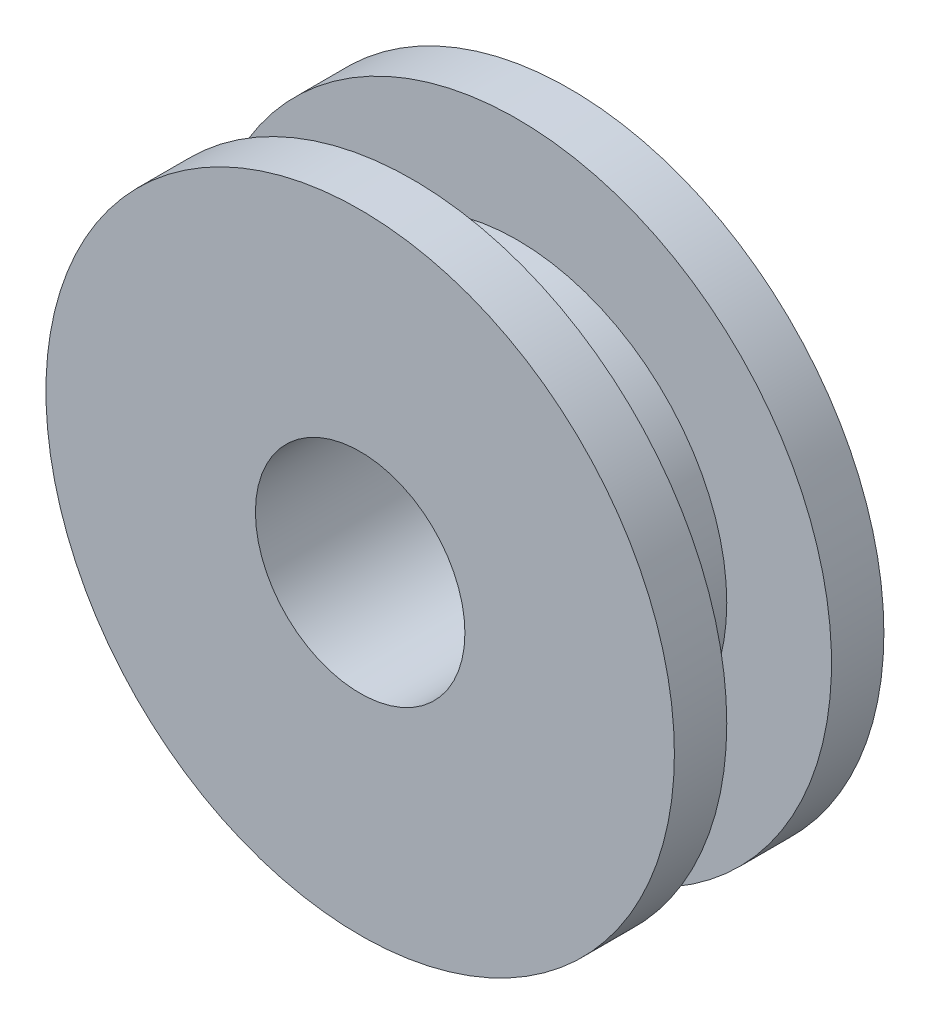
ISO-10303-21;
HEADER;
FILE_DESCRIPTION(('STEP AP214'),'2;1');
FILE_NAME('part.step','',(''),(''),'','','');
FILE_SCHEMA(('AUTOMOTIVE_DESIGN { 1 0 10303 214 1 1 1 1 }'));
ENDSEC;
DATA;
#1=APPLICATION_CONTEXT('core data for automotive mechanical design processes');
#2=APPLICATION_PROTOCOL_DEFINITION('international standard','automotive_design',2000,#1);
#3=PRODUCT_CONTEXT('',#1,'mechanical');
#4=PRODUCT('Part','Part','',(#3));
#5=PRODUCT_RELATED_PRODUCT_CATEGORY('part','',(#4));
#6=PRODUCT_DEFINITION_FORMATION('','',#4);
#7=PRODUCT_DEFINITION_CONTEXT('part definition',#1,'design');
#8=PRODUCT_DEFINITION('design','',#6,#7);
#9=PRODUCT_DEFINITION_SHAPE('','',#8);
#10=(LENGTH_UNIT() NAMED_UNIT(*) SI_UNIT(.MILLI.,.METRE.));
#11=(NAMED_UNIT(*) PLANE_ANGLE_UNIT() SI_UNIT($,.RADIAN.));
#12=(NAMED_UNIT(*) SI_UNIT($,.STERADIAN.) SOLID_ANGLE_UNIT());
#13=UNCERTAINTY_MEASURE_WITH_UNIT(LENGTH_MEASURE(1.E-05),#10,'distance_accuracy_value','');
#14=(GEOMETRIC_REPRESENTATION_CONTEXT(3) GLOBAL_UNCERTAINTY_ASSIGNED_CONTEXT((#13)) GLOBAL_UNIT_ASSIGNED_CONTEXT((#10,
#11,#12)) REPRESENTATION_CONTEXT('',''));
#15=CARTESIAN_POINT('',(0.,0.,0.));
#16=DIRECTION('',(0.,0.,1.));
#17=DIRECTION('',(1.,0.,0.));
#18=AXIS2_PLACEMENT_3D('',#15,#16,#17);
#19=CARTESIAN_POINT('',(0.,0.,40.));
#20=DIRECTION('',(0.,0.,-1.));
#21=DIRECTION('',(-1.,0.,0.));
#22=AXIS2_PLACEMENT_3D('',#19,#20,#21);
#23=CYLINDRICAL_SURFACE('',#22,60.);
#24=CARTESIAN_POINT('',(0.,0.,9.99999999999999));
#25=DIRECTION('',(0.,0.,-1.));
#26=DIRECTION('',(-1.,0.,0.));
#27=AXIS2_PLACEMENT_3D('',#24,#25,#26);
#28=CIRCLE('',#27,60.);
#29=CARTESIAN_POINT('',(-60.,0.,9.99999999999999));
#30=VERTEX_POINT('',#29);
#31=EDGE_CURVE('E33',#30,#30,#28,.T.);
#32=ORIENTED_EDGE('',*,*,#31,.T.);
#33=EDGE_LOOP('',(#32));
#34=FACE_BOUND('',#33,.T.);
#35=CARTESIAN_POINT('',(0.,0.,0.));
#36=DIRECTION('',(0.,0.,1.));
#37=DIRECTION('',(1.,0.,0.));
#38=AXIS2_PLACEMENT_3D('',#35,#36,#37);
#39=CIRCLE('',#38,60.);
#40=CARTESIAN_POINT('',(60.,0.,0.));
#41=VERTEX_POINT('',#40);
#42=EDGE_CURVE('E37',#41,#41,#39,.T.);
#43=ORIENTED_EDGE('',*,*,#42,.T.);
#44=EDGE_LOOP('',(#43));
#45=FACE_BOUND('',#44,.T.);
#46=ADVANCED_FACE('F29',(#34,#45),#23,.T.);
#47=CARTESIAN_POINT('',(0.,0.,0.));
#48=DIRECTION('',(0.,0.,1.));
#49=DIRECTION('',(1.,0.,0.));
#50=AXIS2_PLACEMENT_3D('',#47,#48,#49);
#51=PLANE('',#50);
#52=CARTESIAN_POINT('',(0.,0.,0.));
#53=DIRECTION('',(0.,0.,1.));
#54=DIRECTION('',(1.,0.,0.));
#55=AXIS2_PLACEMENT_3D('',#52,#53,#54);
#56=CIRCLE('',#55,20.);
#57=CARTESIAN_POINT('',(20.,0.,0.));
#58=VERTEX_POINT('',#57);
#59=EDGE_CURVE('E56',#58,#58,#56,.T.);
#60=ORIENTED_EDGE('',*,*,#59,.T.);
#61=EDGE_LOOP('',(#60));
#62=FACE_BOUND('',#61,.T.);
#63=ORIENTED_EDGE('',*,*,#42,.F.);
#64=EDGE_LOOP('',(#63));
#65=FACE_BOUND('',#64,.T.);
#66=ADVANCED_FACE('F81',(#62,#65),#51,.F.);
#67=CARTESIAN_POINT('',(0.,80.,9.99999999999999));
#68=DIRECTION('',(0.,0.,-1.));
#69=DIRECTION('',(-1.,0.,0.));
#70=AXIS2_PLACEMENT_3D('',#67,#68,#69);
#71=PLANE('',#70);
#72=CARTESIAN_POINT('',(0.,0.,9.99999999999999));
#73=DIRECTION('',(0.,0.,-1.));
#74=DIRECTION('',(-1.,0.,0.));
#75=AXIS2_PLACEMENT_3D('',#72,#73,#74);
#76=CIRCLE('',#75,40.);
#77=CARTESIAN_POINT('',(-40.,0.,9.99999999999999));
#78=VERTEX_POINT('',#77);
#79=EDGE_CURVE('E52',#78,#78,#76,.T.);
#80=ORIENTED_EDGE('',*,*,#79,.T.);
#81=EDGE_LOOP('',(#80));
#82=FACE_BOUND('',#81,.T.);
#83=ORIENTED_EDGE('',*,*,#31,.F.);
#84=EDGE_LOOP('',(#83));
#85=FACE_BOUND('',#84,.T.);
#86=ADVANCED_FACE('F86',(#82,#85),#71,.F.);
#87=CARTESIAN_POINT('',(0.,80.,30.));
#88=DIRECTION('',(0.,0.,1.));
#89=DIRECTION('',(1.,0.,0.));
#90=AXIS2_PLACEMENT_3D('',#87,#88,#89);
#91=PLANE('',#90);
#92=CARTESIAN_POINT('',(0.,0.,30.));
#93=DIRECTION('',(0.,0.,-1.));
#94=DIRECTION('',(-1.,0.,0.));
#95=AXIS2_PLACEMENT_3D('',#92,#93,#94);
#96=CIRCLE('',#95,40.);
#97=CARTESIAN_POINT('',(-40.,0.,30.));
#98=VERTEX_POINT('',#97);
#99=EDGE_CURVE('E44',#98,#98,#96,.T.);
#100=ORIENTED_EDGE('',*,*,#99,.F.);
#101=EDGE_LOOP('',(#100));
#102=FACE_BOUND('',#101,.T.);
#103=CARTESIAN_POINT('',(0.,0.,30.));
#104=DIRECTION('',(0.,0.,1.));
#105=DIRECTION('',(1.,0.,0.));
#106=AXIS2_PLACEMENT_3D('',#103,#104,#105);
#107=CIRCLE('',#106,60.);
#108=CARTESIAN_POINT('',(60.,0.,30.));
#109=VERTEX_POINT('',#108);
#110=EDGE_CURVE('E46',#109,#109,#107,.T.);
#111=ORIENTED_EDGE('',*,*,#110,.F.);
#112=EDGE_LOOP('',(#111));
#113=FACE_BOUND('',#112,.T.);
#114=ADVANCED_FACE('F76',(#102,#113),#91,.F.);
#115=CARTESIAN_POINT('',(0.,0.,40.));
#116=DIRECTION('',(0.,0.,-1.));
#117=DIRECTION('',(-1.,0.,0.));
#118=AXIS2_PLACEMENT_3D('',#115,#116,#117);
#119=CYLINDRICAL_SURFACE('',#118,40.);
#120=ORIENTED_EDGE('',*,*,#79,.F.);
#121=EDGE_LOOP('',(#120));
#122=FACE_BOUND('',#121,.T.);
#123=ORIENTED_EDGE('',*,*,#99,.T.);
#124=EDGE_LOOP('',(#123));
#125=FACE_BOUND('',#124,.T.);
#126=ADVANCED_FACE('F70',(#122,#125),#119,.T.);
#127=CARTESIAN_POINT('',(0.,0.,40.));
#128=DIRECTION('',(0.,0.,1.));
#129=DIRECTION('',(1.,0.,0.));
#130=AXIS2_PLACEMENT_3D('',#127,#128,#129);
#131=PLANE('',#130);
#132=CARTESIAN_POINT('',(0.,0.,40.));
#133=DIRECTION('',(0.,0.,1.));
#134=DIRECTION('',(1.,0.,0.));
#135=AXIS2_PLACEMENT_3D('',#132,#133,#134);
#136=CIRCLE('',#135,20.);
#137=CARTESIAN_POINT('',(20.,0.,40.));
#138=VERTEX_POINT('',#137);
#139=EDGE_CURVE('E60',#138,#138,#136,.T.);
#140=ORIENTED_EDGE('',*,*,#139,.F.);
#141=EDGE_LOOP('',(#140));
#142=FACE_BOUND('',#141,.T.);
#143=CARTESIAN_POINT('',(0.,0.,40.));
#144=DIRECTION('',(0.,0.,1.));
#145=DIRECTION('',(1.,0.,0.));
#146=AXIS2_PLACEMENT_3D('',#143,#144,#145);
#147=CIRCLE('',#146,60.);
#148=CARTESIAN_POINT('',(60.,0.,40.));
#149=VERTEX_POINT('',#148);
#150=EDGE_CURVE('E10',#149,#149,#147,.T.);
#151=ORIENTED_EDGE('',*,*,#150,.T.);
#152=EDGE_LOOP('',(#151));
#153=FACE_BOUND('',#152,.T.);
#154=ADVANCED_FACE('F68',(#142,#153),#131,.T.);
#155=ORIENTED_EDGE('',*,*,#110,.T.);
#156=EDGE_LOOP('',(#155));
#157=FACE_BOUND('',#156,.T.);
#158=ORIENTED_EDGE('',*,*,#150,.F.);
#159=EDGE_LOOP('',(#158));
#160=FACE_BOUND('',#159,.T.);
#161=ADVANCED_FACE('F31',(#157,#160),#23,.T.);
#162=CARTESIAN_POINT('',(0.,0.,0.));
#163=DIRECTION('',(0.,0.,1.));
#164=DIRECTION('',(1.,0.,0.));
#165=AXIS2_PLACEMENT_3D('',#162,#163,#164);
#166=CYLINDRICAL_SURFACE('',#165,20.);
#167=ORIENTED_EDGE('',*,*,#59,.F.);
#168=EDGE_LOOP('',(#167));
#169=FACE_BOUND('',#168,.T.);
#170=ORIENTED_EDGE('',*,*,#139,.T.);
#171=EDGE_LOOP('',(#170));
#172=FACE_BOUND('',#171,.T.);
#173=ADVANCED_FACE('F66',(#169,#172),#166,.F.);
#174=CLOSED_SHELL('',(#46,#66,#86,#114,#126,#154,#161,#173));
#175=MANIFOLD_SOLID_BREP('B2',#174);
#176=ADVANCED_BREP_SHAPE_REPRESENTATION('',(#18,#175),#14);
#177=SHAPE_DEFINITION_REPRESENTATION(#9,#176);
ENDSEC;
END-ISO-10303-21;
